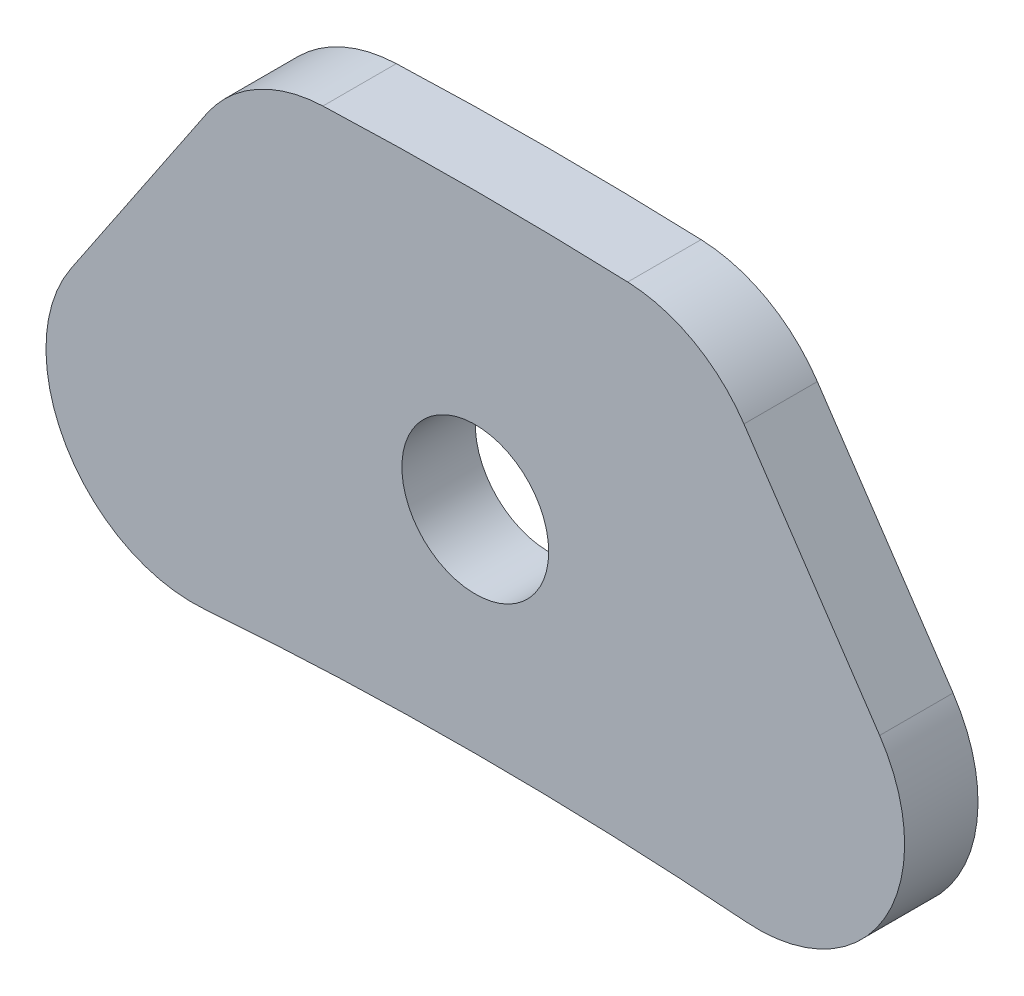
ISO-10303-21;
HEADER;
FILE_DESCRIPTION(('STEP AP214'),'2;1');
FILE_NAME('part.step','',(''),(''),'','','');
FILE_SCHEMA(('AUTOMOTIVE_DESIGN { 1 0 10303 214 1 1 1 1 }'));
ENDSEC;
DATA;
#1=APPLICATION_CONTEXT('core data for automotive mechanical design processes');
#2=APPLICATION_PROTOCOL_DEFINITION('international standard','automotive_design',2000,#1);
#3=PRODUCT_CONTEXT('',#1,'mechanical');
#4=PRODUCT('Part','Part','',(#3));
#5=PRODUCT_RELATED_PRODUCT_CATEGORY('part','',(#4));
#6=PRODUCT_DEFINITION_FORMATION('','',#4);
#7=PRODUCT_DEFINITION_CONTEXT('part definition',#1,'design');
#8=PRODUCT_DEFINITION('design','',#6,#7);
#9=PRODUCT_DEFINITION_SHAPE('','',#8);
#10=(LENGTH_UNIT() NAMED_UNIT(*) SI_UNIT(.MILLI.,.METRE.));
#11=(NAMED_UNIT(*) PLANE_ANGLE_UNIT() SI_UNIT($,.RADIAN.));
#12=(NAMED_UNIT(*) SI_UNIT($,.STERADIAN.) SOLID_ANGLE_UNIT());
#13=UNCERTAINTY_MEASURE_WITH_UNIT(LENGTH_MEASURE(1.E-05),#10,'distance_accuracy_value','');
#14=(GEOMETRIC_REPRESENTATION_CONTEXT(3) GLOBAL_UNCERTAINTY_ASSIGNED_CONTEXT((#13)) GLOBAL_UNIT_ASSIGNED_CONTEXT((#10,
#11,#12)) REPRESENTATION_CONTEXT('',''));
#15=CARTESIAN_POINT('',(0.,0.,0.));
#16=DIRECTION('',(0.,0.,1.));
#17=DIRECTION('',(1.,0.,0.));
#18=AXIS2_PLACEMENT_3D('',#15,#16,#17);
#19=CARTESIAN_POINT('',(3.175,83.442116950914,1.5875));
#20=DIRECTION('',(0.,0.,1.));
#21=DIRECTION('',(1.,0.,0.));
#22=AXIS2_PLACEMENT_3D('',#19,#20,#21);
#23=PLANE('',#22);
#24=CARTESIAN_POINT('',(3.175,83.442116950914,1.5875));
#25=DIRECTION('',(0.,0.,1.));
#26=DIRECTION('',(1.,0.,0.));
#27=AXIS2_PLACEMENT_3D('',#24,#25,#26);
#28=CIRCLE('',#27,3.17500000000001);
#29=CARTESIAN_POINT('',(5.81011425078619,85.2132177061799,1.5875));
#30=VERTEX_POINT('',#29);
#31=CARTESIAN_POINT('',(3.29572243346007,86.6148210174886,1.5875));
#32=VERTEX_POINT('',#31);
#33=EDGE_CURVE('E145',#30,#32,#28,.T.);
#34=ORIENTED_EDGE('',*,*,#33,.T.);
#35=CARTESIAN_POINT('',(0.,0.,1.5875));
#36=DIRECTION('',(0.,0.,1.));
#37=DIRECTION('',(1.,0.,0.));
#38=AXIS2_PLACEMENT_3D('',#35,#36,#37);
#39=CIRCLE('',#38,86.6775);
#40=CARTESIAN_POINT('',(-3.29572243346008,86.6148210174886,1.5875));
#41=VERTEX_POINT('',#40);
#42=EDGE_CURVE('E93',#32,#41,#39,.T.);
#43=ORIENTED_EDGE('',*,*,#42,.T.);
#44=CARTESIAN_POINT('',(-3.175,83.442116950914,1.5875));
#45=DIRECTION('',(0.,0.,1.));
#46=DIRECTION('',(-1.,0.,0.));
#47=AXIS2_PLACEMENT_3D('',#44,#45,#46);
#48=CIRCLE('',#47,3.17500000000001);
#49=CARTESIAN_POINT('',(-5.81011425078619,85.2132177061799,1.5875));
#50=VERTEX_POINT('',#49);
#51=EDGE_CURVE('E160',#41,#50,#48,.T.);
#52=ORIENTED_EDGE('',*,*,#51,.T.);
#53=DIRECTION('',(-0.557827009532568,-0.829957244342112,0.));
#54=VECTOR('',#53,1.);
#55=CARTESIAN_POINT('',(-5.81011425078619,85.2132177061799,1.5875));
#56=LINE('',#55,#54);
#57=CARTESIAN_POINT('',(-8.74476573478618,80.8469263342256,1.5875));
#58=VERTEX_POINT('',#57);
#59=EDGE_CURVE('E173',#50,#58,#56,.T.);
#60=ORIENTED_EDGE('',*,*,#59,.T.);
#61=CARTESIAN_POINT('',(-6.109651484,79.0758255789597,1.5875));
#62=DIRECTION('',(0.,0.,1.));
#63=DIRECTION('',(-1.,0.,0.));
#64=AXIS2_PLACEMENT_3D('',#61,#62,#63);
#65=CIRCLE('',#64,3.17499999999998);
#66=CARTESIAN_POINT('',(-5.86506975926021,75.9102601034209,1.5875));
#67=VERTEX_POINT('',#66);
#68=EDGE_CURVE('E112',#58,#67,#65,.T.);
#69=ORIENTED_EDGE('',*,*,#68,.T.);
#70=CARTESIAN_POINT('',(0.,0.,1.5875));
#71=DIRECTION('',(0.,0.,-1.));
#72=DIRECTION('',(1.,0.,0.));
#73=AXIS2_PLACEMENT_3D('',#70,#71,#72);
#74=CIRCLE('',#73,76.1365);
#75=CARTESIAN_POINT('',(5.86506975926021,75.9102601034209,1.5875));
#76=VERTEX_POINT('',#75);
#77=EDGE_CURVE('E106',#67,#76,#74,.T.);
#78=ORIENTED_EDGE('',*,*,#77,.T.);
#79=CARTESIAN_POINT('',(6.109651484,79.0758255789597,1.5875));
#80=DIRECTION('',(0.,0.,1.));
#81=DIRECTION('',(-1.,0.,0.));
#82=AXIS2_PLACEMENT_3D('',#79,#80,#81);
#83=CIRCLE('',#82,3.17499999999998);
#84=CARTESIAN_POINT('',(8.74476573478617,80.8469263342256,1.5875));
#85=VERTEX_POINT('',#84);
#86=EDGE_CURVE('E110',#76,#85,#83,.T.);
#87=ORIENTED_EDGE('',*,*,#86,.T.);
#88=DIRECTION('',(-0.557827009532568,0.829957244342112,0.));
#89=VECTOR('',#88,1.);
#90=CARTESIAN_POINT('',(5.81011425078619,85.2132177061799,1.5875));
#91=LINE('',#90,#89);
#92=EDGE_CURVE('E50',#85,#30,#91,.T.);
#93=ORIENTED_EDGE('',*,*,#92,.T.);
#94=EDGE_LOOP('',(#34,#43,#52,#60,#69,#78,#87,#93));
#95=FACE_BOUND('',#94,.T.);
#96=CARTESIAN_POINT('',(0.,80.7085,1.5875));
#97=DIRECTION('',(0.,0.,1.));
#98=DIRECTION('',(1.,0.,0.));
#99=AXIS2_PLACEMENT_3D('',#96,#97,#98);
#100=CIRCLE('',#99,1.5875);
#101=CARTESIAN_POINT('',(1.5875,80.7085,1.5875));
#102=VERTEX_POINT('',#101);
#103=EDGE_CURVE('E134',#102,#102,#100,.T.);
#104=ORIENTED_EDGE('',*,*,#103,.F.);
#105=EDGE_LOOP('',(#104));
#106=FACE_BOUND('',#105,.T.);
#107=ADVANCED_FACE('F33',(#95,#106),#23,.T.);
#108=CARTESIAN_POINT('',(3.175,83.442116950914,0.));
#109=DIRECTION('',(0.,0.,1.));
#110=DIRECTION('',(1.,0.,0.));
#111=AXIS2_PLACEMENT_3D('',#108,#109,#110);
#112=PLANE('',#111);
#113=CARTESIAN_POINT('',(3.175,83.442116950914,0.));
#114=DIRECTION('',(0.,0.,1.));
#115=DIRECTION('',(1.,0.,0.));
#116=AXIS2_PLACEMENT_3D('',#113,#114,#115);
#117=CIRCLE('',#116,3.17500000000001);
#118=CARTESIAN_POINT('',(5.81011425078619,85.2132177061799,0.));
#119=VERTEX_POINT('',#118);
#120=CARTESIAN_POINT('',(3.29572243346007,86.6148210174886,0.));
#121=VERTEX_POINT('',#120);
#122=EDGE_CURVE('E130',#119,#121,#117,.T.);
#123=ORIENTED_EDGE('',*,*,#122,.F.);
#124=DIRECTION('',(-0.557827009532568,0.829957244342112,0.));
#125=VECTOR('',#124,1.);
#126=CARTESIAN_POINT('',(5.81011425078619,85.2132177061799,0.));
#127=LINE('',#126,#125);
#128=CARTESIAN_POINT('',(8.74476573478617,80.8469263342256,0.));
#129=VERTEX_POINT('',#128);
#130=EDGE_CURVE('E85',#129,#119,#127,.T.);
#131=ORIENTED_EDGE('',*,*,#130,.F.);
#132=CARTESIAN_POINT('',(6.109651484,79.0758255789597,0.));
#133=DIRECTION('',(0.,0.,1.));
#134=DIRECTION('',(-1.,0.,0.));
#135=AXIS2_PLACEMENT_3D('',#132,#133,#134);
#136=CIRCLE('',#135,3.17499999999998);
#137=CARTESIAN_POINT('',(5.86506975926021,75.9102601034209,0.));
#138=VERTEX_POINT('',#137);
#139=EDGE_CURVE('E79',#138,#129,#136,.T.);
#140=ORIENTED_EDGE('',*,*,#139,.F.);
#141=CARTESIAN_POINT('',(0.,0.,0.));
#142=DIRECTION('',(0.,0.,-1.));
#143=DIRECTION('',(1.,0.,0.));
#144=AXIS2_PLACEMENT_3D('',#141,#142,#143);
#145=CIRCLE('',#144,76.1365);
#146=CARTESIAN_POINT('',(-5.86506975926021,75.9102601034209,0.));
#147=VERTEX_POINT('',#146);
#148=EDGE_CURVE('E120',#147,#138,#145,.T.);
#149=ORIENTED_EDGE('',*,*,#148,.F.);
#150=CARTESIAN_POINT('',(-6.109651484,79.0758255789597,0.));
#151=DIRECTION('',(0.,0.,1.));
#152=DIRECTION('',(-1.,0.,0.));
#153=AXIS2_PLACEMENT_3D('',#150,#151,#152);
#154=CIRCLE('',#153,3.17499999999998);
#155=CARTESIAN_POINT('',(-8.74476573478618,80.8469263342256,0.));
#156=VERTEX_POINT('',#155);
#157=EDGE_CURVE('E140',#156,#147,#154,.T.);
#158=ORIENTED_EDGE('',*,*,#157,.F.);
#159=DIRECTION('',(-0.557827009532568,-0.829957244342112,0.));
#160=VECTOR('',#159,1.);
#161=CARTESIAN_POINT('',(-5.81011425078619,85.2132177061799,0.));
#162=LINE('',#161,#160);
#163=CARTESIAN_POINT('',(-5.81011425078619,85.2132177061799,0.));
#164=VERTEX_POINT('',#163);
#165=EDGE_CURVE('E138',#164,#156,#162,.T.);
#166=ORIENTED_EDGE('',*,*,#165,.F.);
#167=CARTESIAN_POINT('',(-3.175,83.442116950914,0.));
#168=DIRECTION('',(0.,0.,1.));
#169=DIRECTION('',(-1.,0.,0.));
#170=AXIS2_PLACEMENT_3D('',#167,#168,#169);
#171=CIRCLE('',#170,3.17500000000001);
#172=CARTESIAN_POINT('',(-3.29572243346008,86.6148210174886,0.));
#173=VERTEX_POINT('',#172);
#174=EDGE_CURVE('E136',#173,#164,#171,.T.);
#175=ORIENTED_EDGE('',*,*,#174,.F.);
#176=CARTESIAN_POINT('',(0.,0.,0.));
#177=DIRECTION('',(0.,0.,1.));
#178=DIRECTION('',(1.,0.,0.));
#179=AXIS2_PLACEMENT_3D('',#176,#177,#178);
#180=CIRCLE('',#179,86.6775);
#181=EDGE_CURVE('E133',#121,#173,#180,.T.);
#182=ORIENTED_EDGE('',*,*,#181,.F.);
#183=EDGE_LOOP('',(#123,#131,#140,#149,#158,#166,#175,#182));
#184=FACE_BOUND('',#183,.T.);
#185=CARTESIAN_POINT('',(0.,80.7085,0.));
#186=DIRECTION('',(0.,0.,1.));
#187=DIRECTION('',(1.,0.,0.));
#188=AXIS2_PLACEMENT_3D('',#185,#186,#187);
#189=CIRCLE('',#188,1.5875);
#190=CARTESIAN_POINT('',(1.5875,80.7085,0.));
#191=VERTEX_POINT('',#190);
#192=EDGE_CURVE('E179',#191,#191,#189,.T.);
#193=ORIENTED_EDGE('',*,*,#192,.T.);
#194=EDGE_LOOP('',(#193));
#195=FACE_BOUND('',#194,.T.);
#196=ADVANCED_FACE('F164',(#184,#195),#112,.F.);
#197=CARTESIAN_POINT('',(3.175,83.442116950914,1.5875));
#198=DIRECTION('',(0.,0.,-1.));
#199=DIRECTION('',(-1.,0.,0.));
#200=AXIS2_PLACEMENT_3D('',#197,#198,#199);
#201=CYLINDRICAL_SURFACE('',#200,3.17500000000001);
#202=ORIENTED_EDGE('',*,*,#122,.T.);
#203=DIRECTION('',(0.,0.,-1.));
#204=VECTOR('',#203,1.);
#205=CARTESIAN_POINT('',(3.29572243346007,86.6148210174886,1.5875));
#206=LINE('',#205,#204);
#207=EDGE_CURVE('E11',#32,#121,#206,.T.);
#208=ORIENTED_EDGE('',*,*,#207,.F.);
#209=ORIENTED_EDGE('',*,*,#33,.F.);
#210=DIRECTION('',(0.,0.,-1.));
#211=VECTOR('',#210,1.);
#212=CARTESIAN_POINT('',(5.81011425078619,85.2132177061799,1.5875));
#213=LINE('',#212,#211);
#214=EDGE_CURVE('E126',#30,#119,#213,.T.);
#215=ORIENTED_EDGE('',*,*,#214,.T.);
#216=EDGE_LOOP('',(#202,#208,#209,#215));
#217=FACE_BOUND('',#216,.T.);
#218=ADVANCED_FACE('F35',(#217),#201,.T.);
#219=CARTESIAN_POINT('',(0.,0.,1.5875));
#220=DIRECTION('',(0.,0.,-1.));
#221=DIRECTION('',(-1.,0.,0.));
#222=AXIS2_PLACEMENT_3D('',#219,#220,#221);
#223=CYLINDRICAL_SURFACE('',#222,86.6775);
#224=ORIENTED_EDGE('',*,*,#181,.T.);
#225=DIRECTION('',(0.,0.,-1.));
#226=VECTOR('',#225,1.);
#227=CARTESIAN_POINT('',(-3.29572243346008,86.6148210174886,1.5875));
#228=LINE('',#227,#226);
#229=EDGE_CURVE('E42',#41,#173,#228,.T.);
#230=ORIENTED_EDGE('',*,*,#229,.F.);
#231=ORIENTED_EDGE('',*,*,#42,.F.);
#232=ORIENTED_EDGE('',*,*,#207,.T.);
#233=EDGE_LOOP('',(#224,#230,#231,#232));
#234=FACE_BOUND('',#233,.T.);
#235=ADVANCED_FACE('F207',(#234),#223,.T.);
#236=CARTESIAN_POINT('',(-3.175,83.442116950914,1.5875));
#237=DIRECTION('',(0.,0.,-1.));
#238=DIRECTION('',(-1.,0.,0.));
#239=AXIS2_PLACEMENT_3D('',#236,#237,#238);
#240=CYLINDRICAL_SURFACE('',#239,3.17500000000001);
#241=ORIENTED_EDGE('',*,*,#174,.T.);
#242=DIRECTION('',(0.,0.,-1.));
#243=VECTOR('',#242,1.);
#244=CARTESIAN_POINT('',(-5.81011425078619,85.2132177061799,1.5875));
#245=LINE('',#244,#243);
#246=EDGE_CURVE('E152',#50,#164,#245,.T.);
#247=ORIENTED_EDGE('',*,*,#246,.F.);
#248=ORIENTED_EDGE('',*,*,#51,.F.);
#249=ORIENTED_EDGE('',*,*,#229,.T.);
#250=EDGE_LOOP('',(#241,#247,#248,#249));
#251=FACE_BOUND('',#250,.T.);
#252=ADVANCED_FACE('F158',(#251),#240,.T.);
#253=CARTESIAN_POINT('',(-5.81011425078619,85.2132177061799,1.5875));
#254=DIRECTION('',(0.829957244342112,-0.557827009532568,0.));
#255=DIRECTION('',(0.557827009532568,0.829957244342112,0.));
#256=AXIS2_PLACEMENT_3D('',#253,#254,#255);
#257=PLANE('',#256);
#258=ORIENTED_EDGE('',*,*,#165,.T.);
#259=DIRECTION('',(0.,0.,-1.));
#260=VECTOR('',#259,1.);
#261=CARTESIAN_POINT('',(-8.74476573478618,80.8469263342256,1.5875));
#262=LINE('',#261,#260);
#263=EDGE_CURVE('E149',#58,#156,#262,.T.);
#264=ORIENTED_EDGE('',*,*,#263,.F.);
#265=ORIENTED_EDGE('',*,*,#59,.F.);
#266=ORIENTED_EDGE('',*,*,#246,.T.);
#267=EDGE_LOOP('',(#258,#264,#265,#266));
#268=FACE_BOUND('',#267,.T.);
#269=ADVANCED_FACE('F169',(#268),#257,.F.);
#270=CARTESIAN_POINT('',(-6.109651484,79.0758255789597,1.5875));
#271=DIRECTION('',(0.,0.,-1.));
#272=DIRECTION('',(-1.,0.,0.));
#273=AXIS2_PLACEMENT_3D('',#270,#271,#272);
#274=CYLINDRICAL_SURFACE('',#273,3.17499999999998);
#275=ORIENTED_EDGE('',*,*,#157,.T.);
#276=DIRECTION('',(0.,0.,-1.));
#277=VECTOR('',#276,1.);
#278=CARTESIAN_POINT('',(-5.86506975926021,75.9102601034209,1.5875));
#279=LINE('',#278,#277);
#280=EDGE_CURVE('E121',#67,#147,#279,.T.);
#281=ORIENTED_EDGE('',*,*,#280,.F.);
#282=ORIENTED_EDGE('',*,*,#68,.F.);
#283=ORIENTED_EDGE('',*,*,#263,.T.);
#284=EDGE_LOOP('',(#275,#281,#282,#283));
#285=FACE_BOUND('',#284,.T.);
#286=ADVANCED_FACE('F172',(#285),#274,.T.);
#287=CARTESIAN_POINT('',(0.,0.,1.5875));
#288=DIRECTION('',(0.,0.,-1.));
#289=DIRECTION('',(-1.,0.,0.));
#290=AXIS2_PLACEMENT_3D('',#287,#288,#289);
#291=CYLINDRICAL_SURFACE('',#290,76.1365);
#292=ORIENTED_EDGE('',*,*,#148,.T.);
#293=DIRECTION('',(0.,0.,-1.));
#294=VECTOR('',#293,1.);
#295=CARTESIAN_POINT('',(5.86506975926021,75.9102601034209,1.5875));
#296=LINE('',#295,#294);
#297=EDGE_CURVE('E117',#76,#138,#296,.T.);
#298=ORIENTED_EDGE('',*,*,#297,.F.);
#299=ORIENTED_EDGE('',*,*,#77,.F.);
#300=ORIENTED_EDGE('',*,*,#280,.T.);
#301=EDGE_LOOP('',(#292,#298,#299,#300));
#302=FACE_BOUND('',#301,.T.);
#303=ADVANCED_FACE('F118',(#302),#291,.F.);
#304=CARTESIAN_POINT('',(6.109651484,79.0758255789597,1.5875));
#305=DIRECTION('',(0.,0.,-1.));
#306=DIRECTION('',(-1.,0.,0.));
#307=AXIS2_PLACEMENT_3D('',#304,#305,#306);
#308=CYLINDRICAL_SURFACE('',#307,3.17499999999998);
#309=ORIENTED_EDGE('',*,*,#139,.T.);
#310=DIRECTION('',(0.,0.,-1.));
#311=VECTOR('',#310,1.);
#312=CARTESIAN_POINT('',(8.74476573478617,80.8469263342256,1.5875));
#313=LINE('',#312,#311);
#314=EDGE_CURVE('E122',#85,#129,#313,.T.);
#315=ORIENTED_EDGE('',*,*,#314,.F.);
#316=ORIENTED_EDGE('',*,*,#86,.F.);
#317=ORIENTED_EDGE('',*,*,#297,.T.);
#318=EDGE_LOOP('',(#309,#315,#316,#317));
#319=FACE_BOUND('',#318,.T.);
#320=ADVANCED_FACE('F124',(#319),#308,.T.);
#321=CARTESIAN_POINT('',(5.81011425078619,85.2132177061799,1.5875));
#322=DIRECTION('',(-0.829957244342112,-0.557827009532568,0.));
#323=DIRECTION('',(0.557827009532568,-0.829957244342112,0.));
#324=AXIS2_PLACEMENT_3D('',#321,#322,#323);
#325=PLANE('',#324);
#326=ORIENTED_EDGE('',*,*,#130,.T.);
#327=ORIENTED_EDGE('',*,*,#214,.F.);
#328=ORIENTED_EDGE('',*,*,#92,.F.);
#329=ORIENTED_EDGE('',*,*,#314,.T.);
#330=EDGE_LOOP('',(#326,#327,#328,#329));
#331=FACE_BOUND('',#330,.T.);
#332=ADVANCED_FACE('F195',(#331),#325,.F.);
#333=CARTESIAN_POINT('',(0.,80.7085,1.5875));
#334=DIRECTION('',(0.,0.,-1.));
#335=DIRECTION('',(-1.,0.,0.));
#336=AXIS2_PLACEMENT_3D('',#333,#334,#335);
#337=CYLINDRICAL_SURFACE('',#336,1.5875);
#338=ORIENTED_EDGE('',*,*,#103,.T.);
#339=EDGE_LOOP('',(#338));
#340=FACE_BOUND('',#339,.T.);
#341=ORIENTED_EDGE('',*,*,#192,.F.);
#342=EDGE_LOOP('',(#341));
#343=FACE_BOUND('',#342,.T.);
#344=ADVANCED_FACE('F185',(#340,#343),#337,.F.);
#345=CLOSED_SHELL('',(#107,#196,#218,#235,#252,#269,#286,#303,#320,#332,#344));
#346=MANIFOLD_SOLID_BREP('B2',#345);
#347=ADVANCED_BREP_SHAPE_REPRESENTATION('',(#18,#346),#14);
#348=SHAPE_DEFINITION_REPRESENTATION(#9,#347);
ENDSEC;
END-ISO-10303-21;
